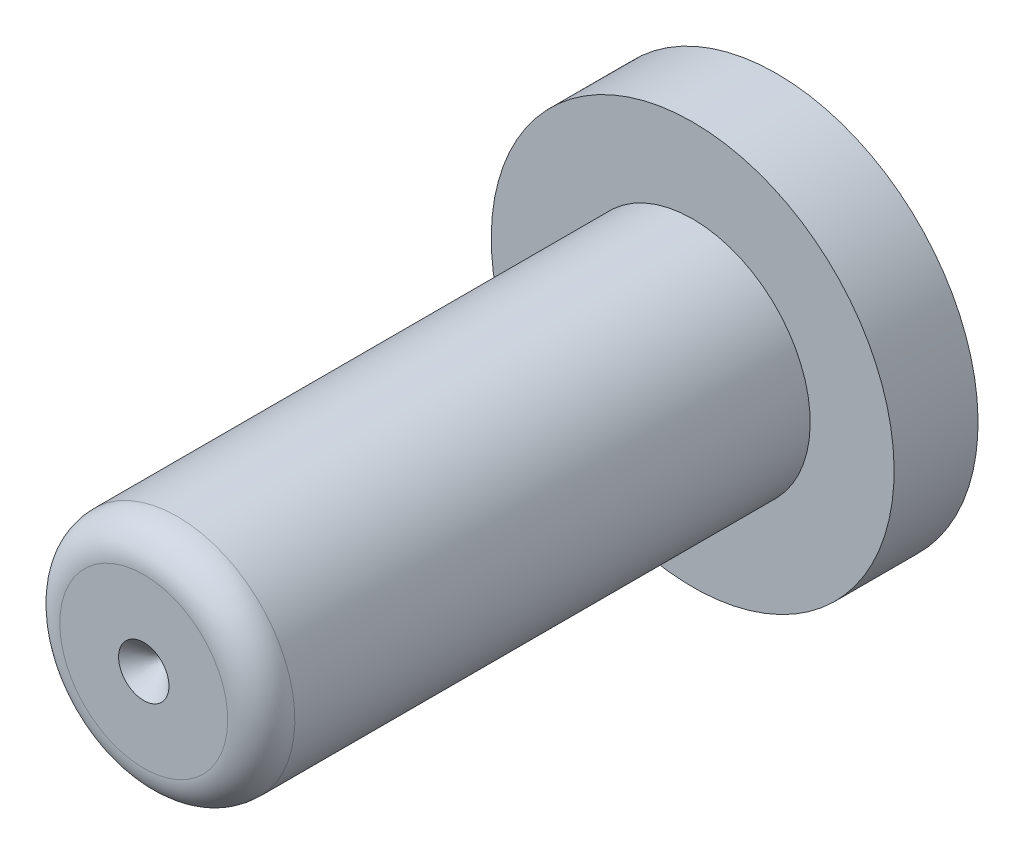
ISO-10303-21;
HEADER;
FILE_DESCRIPTION(('STEP AP214'),'2;1');
FILE_NAME('part.step','',(''),(''),'','','');
FILE_SCHEMA(('AUTOMOTIVE_DESIGN { 1 0 10303 214 1 1 1 1 }'));
ENDSEC;
DATA;
#1=APPLICATION_CONTEXT('core data for automotive mechanical design processes');
#2=APPLICATION_PROTOCOL_DEFINITION('international standard','automotive_design',2000,#1);
#3=PRODUCT_CONTEXT('',#1,'mechanical');
#4=PRODUCT('Part','Part','',(#3));
#5=PRODUCT_RELATED_PRODUCT_CATEGORY('part','',(#4));
#6=PRODUCT_DEFINITION_FORMATION('','',#4);
#7=PRODUCT_DEFINITION_CONTEXT('part definition',#1,'design');
#8=PRODUCT_DEFINITION('design','',#6,#7);
#9=PRODUCT_DEFINITION_SHAPE('','',#8);
#10=(LENGTH_UNIT() NAMED_UNIT(*) SI_UNIT(.MILLI.,.METRE.));
#11=(NAMED_UNIT(*) PLANE_ANGLE_UNIT() SI_UNIT($,.RADIAN.));
#12=(NAMED_UNIT(*) SI_UNIT($,.STERADIAN.) SOLID_ANGLE_UNIT());
#13=UNCERTAINTY_MEASURE_WITH_UNIT(LENGTH_MEASURE(1.E-05),#10,'distance_accuracy_value','');
#14=(GEOMETRIC_REPRESENTATION_CONTEXT(3) GLOBAL_UNCERTAINTY_ASSIGNED_CONTEXT((#13)) GLOBAL_UNIT_ASSIGNED_CONTEXT((#10,
#11,#12)) REPRESENTATION_CONTEXT('',''));
#15=CARTESIAN_POINT('',(0.,0.,0.));
#16=DIRECTION('',(0.,0.,1.));
#17=DIRECTION('',(1.,0.,0.));
#18=AXIS2_PLACEMENT_3D('',#15,#16,#17);
#19=CARTESIAN_POINT('',(0.,0.,0.));
#20=DIRECTION('',(0.,0.,-1.));
#21=DIRECTION('',(0.,1.,0.));
#22=AXIS2_PLACEMENT_3D('',#19,#20,#21);
#23=PLANE('',#22);
#24=CARTESIAN_POINT('',(0.,0.,0.));
#25=DIRECTION('',(0.,0.,-1.));
#26=DIRECTION('',(0.,1.,0.));
#27=AXIS2_PLACEMENT_3D('',#24,#25,#26);
#28=CIRCLE('',#27,12.);
#29=CARTESIAN_POINT('',(0.,12.,0.));
#30=VERTEX_POINT('',#29);
#31=EDGE_CURVE('E11',#30,#30,#28,.T.);
#32=ORIENTED_EDGE('',*,*,#31,.T.);
#33=EDGE_LOOP('',(#32));
#34=FACE_BOUND('',#33,.T.);
#35=ADVANCED_FACE('F32',(#34),#23,.T.);
#36=CARTESIAN_POINT('',(0.,0.,0.));
#37=DIRECTION('',(0.,0.,-1.));
#38=DIRECTION('',(0.,1.,0.));
#39=AXIS2_PLACEMENT_3D('',#36,#37,#38);
#40=CYLINDRICAL_SURFACE('',#39,12.);
#41=CARTESIAN_POINT('',(0.,0.,5.));
#42=DIRECTION('',(0.,0.,-1.));
#43=DIRECTION('',(0.,1.,0.));
#44=AXIS2_PLACEMENT_3D('',#41,#42,#43);
#45=CIRCLE('',#44,12.);
#46=CARTESIAN_POINT('',(0.,12.,5.));
#47=VERTEX_POINT('',#46);
#48=EDGE_CURVE('E38',#47,#47,#45,.T.);
#49=ORIENTED_EDGE('',*,*,#48,.T.);
#50=EDGE_LOOP('',(#49));
#51=FACE_BOUND('',#50,.T.);
#52=ORIENTED_EDGE('',*,*,#31,.F.);
#53=EDGE_LOOP('',(#52));
#54=FACE_BOUND('',#53,.T.);
#55=ADVANCED_FACE('F63',(#51,#54),#40,.T.);
#56=CARTESIAN_POINT('',(0.,12.,5.));
#57=DIRECTION('',(0.,0.,1.));
#58=DIRECTION('',(0.,-1.,0.));
#59=AXIS2_PLACEMENT_3D('',#56,#57,#58);
#60=PLANE('',#59);
#61=CARTESIAN_POINT('',(0.,0.,5.));
#62=DIRECTION('',(0.,0.,-1.));
#63=DIRECTION('',(0.,1.,0.));
#64=AXIS2_PLACEMENT_3D('',#61,#62,#63);
#65=CIRCLE('',#64,7.);
#66=CARTESIAN_POINT('',(0.,7.,5.));
#67=VERTEX_POINT('',#66);
#68=EDGE_CURVE('E58',#67,#67,#65,.T.);
#69=ORIENTED_EDGE('',*,*,#68,.T.);
#70=EDGE_LOOP('',(#69));
#71=FACE_BOUND('',#70,.T.);
#72=ORIENTED_EDGE('',*,*,#48,.F.);
#73=EDGE_LOOP('',(#72));
#74=FACE_BOUND('',#73,.T.);
#75=ADVANCED_FACE('F66',(#71,#74),#60,.T.);
#76=CARTESIAN_POINT('',(0.,0.,0.));
#77=DIRECTION('',(0.,0.,-1.));
#78=DIRECTION('',(0.,1.,0.));
#79=AXIS2_PLACEMENT_3D('',#76,#77,#78);
#80=CYLINDRICAL_SURFACE('',#79,7.);
#81=CARTESIAN_POINT('',(0.,0.,35.7));
#82=DIRECTION('',(0.,0.,-1.));
#83=DIRECTION('',(0.,1.,0.));
#84=AXIS2_PLACEMENT_3D('',#81,#82,#83);
#85=CIRCLE('',#84,7.);
#86=CARTESIAN_POINT('',(0.,7.,35.7));
#87=VERTEX_POINT('',#86);
#88=EDGE_CURVE('E53',#87,#87,#85,.T.);
#89=ORIENTED_EDGE('',*,*,#88,.T.);
#90=EDGE_LOOP('',(#89));
#91=FACE_BOUND('',#90,.T.);
#92=ORIENTED_EDGE('',*,*,#68,.F.);
#93=EDGE_LOOP('',(#92));
#94=FACE_BOUND('',#93,.T.);
#95=ADVANCED_FACE('F68',(#91,#94),#80,.T.);
#96=CARTESIAN_POINT('',(0.,0.,35.7));
#97=DIRECTION('',(0.,0.,-1.));
#98=DIRECTION('',(0.,1.,0.));
#99=AXIS2_PLACEMENT_3D('',#96,#97,#98);
#100=TOROIDAL_SURFACE('',#99,5.,2.);
#101=CARTESIAN_POINT('',(0.,0.,37.7));
#102=DIRECTION('',(0.,0.,-1.));
#103=DIRECTION('',(0.,1.,0.));
#104=AXIS2_PLACEMENT_3D('',#101,#102,#103);
#105=CIRCLE('',#104,5.);
#106=CARTESIAN_POINT('',(0.,5.,37.7));
#107=VERTEX_POINT('',#106);
#108=EDGE_CURVE('E50',#107,#107,#105,.T.);
#109=ORIENTED_EDGE('',*,*,#108,.T.);
#110=EDGE_LOOP('',(#109));
#111=FACE_BOUND('',#110,.T.);
#112=ORIENTED_EDGE('',*,*,#88,.F.);
#113=EDGE_LOOP('',(#112));
#114=FACE_BOUND('',#113,.T.);
#115=ADVANCED_FACE('F75',(#111,#114),#100,.T.);
#116=CARTESIAN_POINT('',(0.,5.,37.7));
#117=DIRECTION('',(0.,0.,1.));
#118=DIRECTION('',(0.,-1.,0.));
#119=AXIS2_PLACEMENT_3D('',#116,#117,#118);
#120=PLANE('',#119);
#121=CARTESIAN_POINT('',(0.,0.,37.7));
#122=DIRECTION('',(0.,0.,-1.));
#123=DIRECTION('',(0.,1.,0.));
#124=AXIS2_PLACEMENT_3D('',#121,#122,#123);
#125=CIRCLE('',#124,1.49999999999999);
#126=CARTESIAN_POINT('',(0.,1.49999999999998,37.7));
#127=VERTEX_POINT('',#126);
#128=EDGE_CURVE('E48',#127,#127,#125,.T.);
#129=ORIENTED_EDGE('',*,*,#128,.T.);
#130=EDGE_LOOP('',(#129));
#131=FACE_BOUND('',#130,.T.);
#132=ORIENTED_EDGE('',*,*,#108,.F.);
#133=EDGE_LOOP('',(#132));
#134=FACE_BOUND('',#133,.T.);
#135=ADVANCED_FACE('F44',(#131,#134),#120,.T.);
#136=CARTESIAN_POINT('',(0.,0.,37.7));
#137=DIRECTION('',(0.,0.,1.));
#138=DIRECTION('',(0.,-1.,0.));
#139=AXIS2_PLACEMENT_3D('',#136,#137,#138);
#140=CONICAL_SURFACE('',#139,1.49999999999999,0.785398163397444);
#141=CARTESIAN_POINT('',(0.,0.,36.2));
#142=VERTEX_POINT('',#141);
#143=VERTEX_LOOP('',#142);
#144=FACE_BOUND('',#143,.T.);
#145=ORIENTED_EDGE('',*,*,#128,.F.);
#146=EDGE_LOOP('',(#145));
#147=FACE_BOUND('',#146,.T.);
#148=ADVANCED_FACE('F41',(#144,#147),#140,.F.);
#149=CLOSED_SHELL('',(#35,#55,#75,#95,#115,#135,#148));
#150=MANIFOLD_SOLID_BREP('B2',#149);
#151=ADVANCED_BREP_SHAPE_REPRESENTATION('',(#18,#150),#14);
#152=SHAPE_DEFINITION_REPRESENTATION(#9,#151);
ENDSEC;
END-ISO-10303-21;
